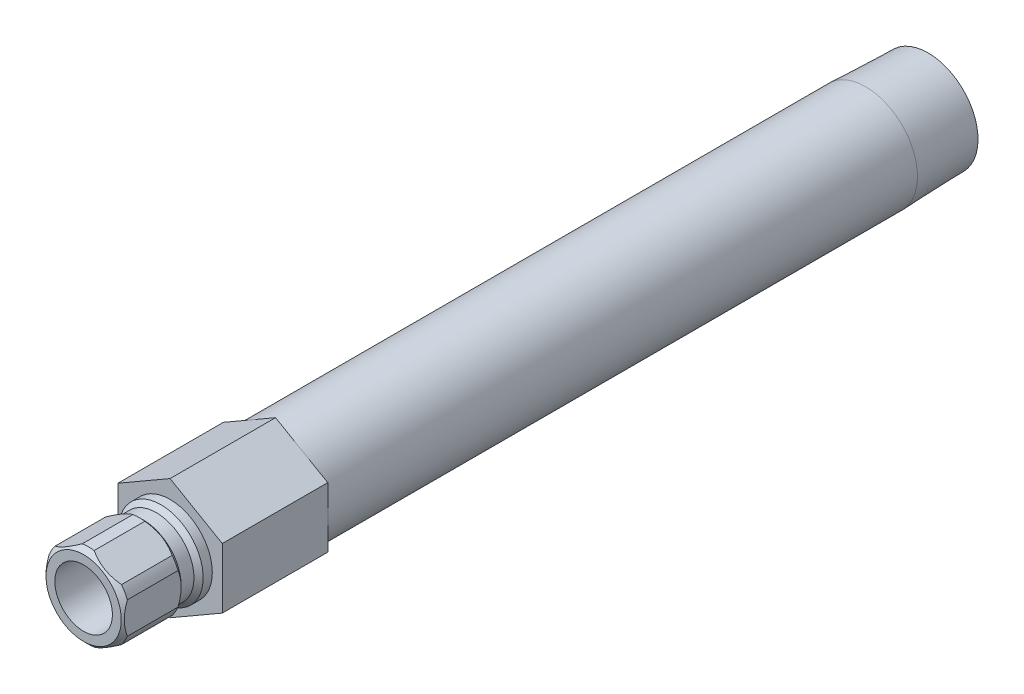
ISO-10303-21;
HEADER;
FILE_DESCRIPTION(('STEP AP214'),'2;1');
FILE_NAME('part.step','',(''),(''),'','','');
FILE_SCHEMA(('AUTOMOTIVE_DESIGN { 1 0 10303 214 1 1 1 1 }'));
ENDSEC;
DATA;
#1=APPLICATION_CONTEXT('core data for automotive mechanical design processes');
#2=APPLICATION_PROTOCOL_DEFINITION('international standard','automotive_design',2000,#1);
#3=PRODUCT_CONTEXT('',#1,'mechanical');
#4=PRODUCT('Part','Part','',(#3));
#5=PRODUCT_RELATED_PRODUCT_CATEGORY('part','',(#4));
#6=PRODUCT_DEFINITION_FORMATION('','',#4);
#7=PRODUCT_DEFINITION_CONTEXT('part definition',#1,'design');
#8=PRODUCT_DEFINITION('design','',#6,#7);
#9=PRODUCT_DEFINITION_SHAPE('','',#8);
#10=(LENGTH_UNIT() NAMED_UNIT(*) SI_UNIT(.MILLI.,.METRE.));
#11=(NAMED_UNIT(*) PLANE_ANGLE_UNIT() SI_UNIT($,.RADIAN.));
#12=(NAMED_UNIT(*) SI_UNIT($,.STERADIAN.) SOLID_ANGLE_UNIT());
#13=UNCERTAINTY_MEASURE_WITH_UNIT(LENGTH_MEASURE(1.E-05),#10,'distance_accuracy_value','');
#14=(GEOMETRIC_REPRESENTATION_CONTEXT(3) GLOBAL_UNCERTAINTY_ASSIGNED_CONTEXT((#13)) GLOBAL_UNIT_ASSIGNED_CONTEXT((#10,
#11,#12)) REPRESENTATION_CONTEXT('',''));
#15=CARTESIAN_POINT('',(0.,0.,0.));
#16=DIRECTION('',(0.,0.,1.));
#17=DIRECTION('',(1.,0.,0.));
#18=AXIS2_PLACEMENT_3D('',#15,#16,#17);
#19=CARTESIAN_POINT('',(0.,0.,0.));
#20=DIRECTION('',(0.,0.,-1.));
#21=DIRECTION('',(0.,1.,0.));
#22=AXIS2_PLACEMENT_3D('',#19,#20,#21);
#23=CYLINDRICAL_SURFACE('',#22,6.985);
#24=DIRECTION('',(0.,0.,-1.));
#25=VECTOR('',#24,1.);
#26=CARTESIAN_POINT('',(5.50323442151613,-4.30170151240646,0.));
#27=LINE('',#26,#25);
#28=CARTESIAN_POINT('',(5.50323442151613,-4.30170151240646,5.1562));
#29=VERTEX_POINT('',#28);
#30=CARTESIAN_POINT('',(5.50323442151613,-4.30170151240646,13.5382));
#31=VERTEX_POINT('',#30);
#32=EDGE_CURVE('E406',#29,#31,#27,.F.);
#33=ORIENTED_EDGE('',*,*,#32,.F.);
#34=CARTESIAN_POINT('',(0.,0.,5.1562));
#35=DIRECTION('',(0.,0.,-1.));
#36=DIRECTION('',(0.,1.,0.));
#37=AXIS2_PLACEMENT_3D('',#34,#35,#36);
#38=CIRCLE('',#37,6.985);
#39=CARTESIAN_POINT('',(6.477,-2.6150900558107,5.1562));
#40=VERTEX_POINT('',#39);
#41=EDGE_CURVE('E383',#40,#29,#38,.T.);
#42=ORIENTED_EDGE('',*,*,#41,.F.);
#43=DIRECTION('',(0.,0.,-1.));
#44=VECTOR('',#43,1.);
#45=CARTESIAN_POINT('',(6.477,-2.6150900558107,0.));
#46=LINE('',#45,#44);
#47=CARTESIAN_POINT('',(6.477,-2.6150900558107,13.5382));
#48=VERTEX_POINT('',#47);
#49=EDGE_CURVE('E397',#48,#40,#46,.T.);
#50=ORIENTED_EDGE('',*,*,#49,.F.);
#51=CARTESIAN_POINT('',(0.,0.,13.5382));
#52=DIRECTION('',(0.,0.,-1.));
#53=DIRECTION('',(0.,1.,0.));
#54=AXIS2_PLACEMENT_3D('',#51,#52,#53);
#55=CIRCLE('',#54,6.985);
#56=EDGE_CURVE('E191',#48,#31,#55,.T.);
#57=ORIENTED_EDGE('',*,*,#56,.T.);
#58=EDGE_LOOP('',(#33,#42,#50,#57));
#59=FACE_BOUND('',#58,.T.);
#60=ADVANCED_FACE('F34',(#59),#23,.T.);
#61=DIRECTION('',(0.,0.,-1.));
#62=VECTOR('',#61,1.);
#63=CARTESIAN_POINT('',(6.477,2.61509005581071,0.));
#64=LINE('',#63,#62);
#65=CARTESIAN_POINT('',(6.477,2.6150900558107,5.1562));
#66=VERTEX_POINT('',#65);
#67=CARTESIAN_POINT('',(6.477,2.61509005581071,13.5382));
#68=VERTEX_POINT('',#67);
#69=EDGE_CURVE('E309',#66,#68,#64,.F.);
#70=ORIENTED_EDGE('',*,*,#69,.F.);
#71=CARTESIAN_POINT('',(5.50323442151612,4.30170151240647,5.1562));
#72=VERTEX_POINT('',#71);
#73=EDGE_CURVE('E204',#72,#66,#38,.T.);
#74=ORIENTED_EDGE('',*,*,#73,.F.);
#75=DIRECTION('',(0.,0.,-1.));
#76=VECTOR('',#75,1.);
#77=CARTESIAN_POINT('',(5.50323442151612,4.30170151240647,0.));
#78=LINE('',#77,#76);
#79=CARTESIAN_POINT('',(5.50323442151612,4.30170151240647,13.5382));
#80=VERTEX_POINT('',#79);
#81=EDGE_CURVE('E394',#80,#72,#78,.T.);
#82=ORIENTED_EDGE('',*,*,#81,.F.);
#83=EDGE_CURVE('E198',#80,#68,#55,.T.);
#84=ORIENTED_EDGE('',*,*,#83,.T.);
#85=EDGE_LOOP('',(#70,#74,#82,#84));
#86=FACE_BOUND('',#85,.T.);
#87=ADVANCED_FACE('F343',(#86),#23,.T.);
#88=DIRECTION('',(0.,0.,-1.));
#89=VECTOR('',#88,1.);
#90=CARTESIAN_POINT('',(0.973765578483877,6.91679156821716,0.));
#91=LINE('',#90,#89);
#92=CARTESIAN_POINT('',(0.973765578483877,6.91679156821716,5.1562));
#93=VERTEX_POINT('',#92);
#94=CARTESIAN_POINT('',(0.973765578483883,6.91679156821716,13.5382));
#95=VERTEX_POINT('',#94);
#96=EDGE_CURVE('E399',#93,#95,#91,.F.);
#97=ORIENTED_EDGE('',*,*,#96,.F.);
#98=CARTESIAN_POINT('',(-0.973765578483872,6.91679156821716,5.1562));
#99=VERTEX_POINT('',#98);
#100=EDGE_CURVE('E200',#99,#93,#38,.T.);
#101=ORIENTED_EDGE('',*,*,#100,.F.);
#102=DIRECTION('',(0.,0.,-1.));
#103=VECTOR('',#102,1.);
#104=CARTESIAN_POINT('',(-0.973765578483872,6.91679156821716,0.));
#105=LINE('',#104,#103);
#106=CARTESIAN_POINT('',(-0.973765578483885,6.91679156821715,13.5382));
#107=VERTEX_POINT('',#106);
#108=EDGE_CURVE('E375',#107,#99,#105,.T.);
#109=ORIENTED_EDGE('',*,*,#108,.F.);
#110=EDGE_CURVE('E193',#107,#95,#55,.T.);
#111=ORIENTED_EDGE('',*,*,#110,.T.);
#112=EDGE_LOOP('',(#97,#101,#109,#111));
#113=FACE_BOUND('',#112,.T.);
#114=ADVANCED_FACE('F348',(#113),#23,.T.);
#115=DIRECTION('',(0.,0.,-1.));
#116=VECTOR('',#115,1.);
#117=CARTESIAN_POINT('',(-5.50323442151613,4.30170151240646,0.));
#118=LINE('',#117,#116);
#119=CARTESIAN_POINT('',(-5.50323442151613,4.30170151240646,5.1562));
#120=VERTEX_POINT('',#119);
#121=CARTESIAN_POINT('',(-5.50323442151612,4.30170151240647,13.5382));
#122=VERTEX_POINT('',#121);
#123=EDGE_CURVE('E54',#120,#122,#118,.F.);
#124=ORIENTED_EDGE('',*,*,#123,.F.);
#125=CARTESIAN_POINT('',(-6.477,2.61509005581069,5.1562));
#126=VERTEX_POINT('',#125);
#127=EDGE_CURVE('E203',#126,#120,#38,.T.);
#128=ORIENTED_EDGE('',*,*,#127,.F.);
#129=DIRECTION('',(0.,0.,-1.));
#130=VECTOR('',#129,1.);
#131=CARTESIAN_POINT('',(-6.477,2.61509005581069,0.));
#132=LINE('',#131,#130);
#133=CARTESIAN_POINT('',(-6.477,2.61509005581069,13.5382));
#134=VERTEX_POINT('',#133);
#135=EDGE_CURVE('E263',#134,#126,#132,.T.);
#136=ORIENTED_EDGE('',*,*,#135,.F.);
#137=EDGE_CURVE('E189',#134,#122,#55,.T.);
#138=ORIENTED_EDGE('',*,*,#137,.T.);
#139=EDGE_LOOP('',(#124,#128,#136,#138));
#140=FACE_BOUND('',#139,.T.);
#141=ADVANCED_FACE('F360',(#140),#23,.T.);
#142=DIRECTION('',(0.,0.,-1.));
#143=VECTOR('',#142,1.);
#144=CARTESIAN_POINT('',(-6.477,-2.61509005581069,0.));
#145=LINE('',#144,#143);
#146=CARTESIAN_POINT('',(-6.477,-2.61509005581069,5.1562));
#147=VERTEX_POINT('',#146);
#148=CARTESIAN_POINT('',(-6.477,-2.6150900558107,13.5382));
#149=VERTEX_POINT('',#148);
#150=EDGE_CURVE('E62',#147,#149,#145,.F.);
#151=ORIENTED_EDGE('',*,*,#150,.F.);
#152=CARTESIAN_POINT('',(-5.50323442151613,-4.30170151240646,5.1562));
#153=VERTEX_POINT('',#152);
#154=EDGE_CURVE('E182',#153,#147,#38,.T.);
#155=ORIENTED_EDGE('',*,*,#154,.F.);
#156=DIRECTION('',(0.,0.,-1.));
#157=VECTOR('',#156,1.);
#158=CARTESIAN_POINT('',(-5.50323442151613,-4.30170151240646,0.));
#159=LINE('',#158,#157);
#160=CARTESIAN_POINT('',(-5.50323442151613,-4.30170151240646,13.5382));
#161=VERTEX_POINT('',#160);
#162=EDGE_CURVE('E165',#161,#153,#159,.T.);
#163=ORIENTED_EDGE('',*,*,#162,.F.);
#164=EDGE_CURVE('E180',#161,#149,#55,.T.);
#165=ORIENTED_EDGE('',*,*,#164,.T.);
#166=EDGE_LOOP('',(#151,#155,#163,#165));
#167=FACE_BOUND('',#166,.T.);
#168=ADVANCED_FACE('F179',(#167),#23,.T.);
#169=CARTESIAN_POINT('',(0.,0.,0.));
#170=DIRECTION('',(0.,0.,-1.));
#171=DIRECTION('',(0.,1.,0.));
#172=AXIS2_PLACEMENT_3D('',#169,#170,#171);
#173=CYLINDRICAL_SURFACE('',#172,8.57249999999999);
#174=CARTESIAN_POINT('',(0.,0.,-115.062));
#175=DIRECTION('',(0.,0.,-1.));
#176=DIRECTION('',(0.,1.,0.));
#177=AXIS2_PLACEMENT_3D('',#174,#175,#176);
#178=CIRCLE('',#177,8.57249999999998);
#179=CARTESIAN_POINT('',(0.,8.5725,-115.062));
#180=VERTEX_POINT('',#179);
#181=EDGE_CURVE('E214',#180,#180,#178,.T.);
#182=ORIENTED_EDGE('',*,*,#181,.F.);
#183=EDGE_LOOP('',(#182));
#184=FACE_BOUND('',#183,.T.);
#185=CARTESIAN_POINT('',(0.,0.,-17.4498));
#186=DIRECTION('',(0.,0.,1.));
#187=DIRECTION('',(1.,0.,0.));
#188=AXIS2_PLACEMENT_3D('',#185,#186,#187);
#189=CIRCLE('',#188,8.57249999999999);
#190=CARTESIAN_POINT('',(8.57249999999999,0.,-17.4498));
#191=VERTEX_POINT('',#190);
#192=EDGE_CURVE('E231',#191,#191,#189,.F.);
#193=ORIENTED_EDGE('',*,*,#192,.T.);
#194=EDGE_LOOP('',(#193));
#195=FACE_BOUND('',#194,.T.);
#196=ADVANCED_FACE('F359',(#184,#195),#173,.T.);
#197=CARTESIAN_POINT('',(0.,0.,0.));
#198=DIRECTION('',(0.,0.,-1.));
#199=DIRECTION('',(0.,1.,0.));
#200=AXIS2_PLACEMENT_3D('',#197,#198,#199);
#201=CYLINDRICAL_SURFACE('',#200,4.76249999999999);
#202=CARTESIAN_POINT('',(0.,0.,14.3002));
#203=DIRECTION('',(0.,0.,-1.));
#204=DIRECTION('',(0.,1.,0.));
#205=AXIS2_PLACEMENT_3D('',#202,#203,#204);
#206=CIRCLE('',#205,4.7625);
#207=CARTESIAN_POINT('',(0.,4.7625,14.3002));
#208=VERTEX_POINT('',#207);
#209=EDGE_CURVE('E233',#208,#208,#206,.T.);
#210=ORIENTED_EDGE('',*,*,#209,.F.);
#211=EDGE_LOOP('',(#210));
#212=FACE_BOUND('',#211,.T.);
#213=CARTESIAN_POINT('',(0.,0.,-17.4498));
#214=DIRECTION('',(0.,0.,-1.));
#215=DIRECTION('',(0.,1.,0.));
#216=AXIS2_PLACEMENT_3D('',#213,#214,#215);
#217=CIRCLE('',#216,4.76249999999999);
#218=CARTESIAN_POINT('',(0.,4.7625,-17.4498));
#219=VERTEX_POINT('',#218);
#220=EDGE_CURVE('E226',#219,#219,#217,.T.);
#221=ORIENTED_EDGE('',*,*,#220,.T.);
#222=EDGE_LOOP('',(#221));
#223=FACE_BOUND('',#222,.T.);
#224=ADVANCED_FACE('F36',(#212,#223),#201,.F.);
#225=CARTESIAN_POINT('',(0.,4.7625,-17.4498));
#226=DIRECTION('',(0.,0.,-1.));
#227=DIRECTION('',(0.,1.,0.));
#228=AXIS2_PLACEMENT_3D('',#225,#226,#227);
#229=PLANE('',#228);
#230=CARTESIAN_POINT('',(0.,0.,-17.4498));
#231=DIRECTION('',(0.,0.,-1.));
#232=DIRECTION('',(0.,1.,0.));
#233=AXIS2_PLACEMENT_3D('',#230,#231,#232);
#234=CIRCLE('',#233,6.26109999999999);
#235=CARTESIAN_POINT('',(0.,6.2611,-17.4498));
#236=VERTEX_POINT('',#235);
#237=EDGE_CURVE('E223',#236,#236,#234,.T.);
#238=ORIENTED_EDGE('',*,*,#237,.T.);
#239=EDGE_LOOP('',(#238));
#240=FACE_BOUND('',#239,.T.);
#241=ORIENTED_EDGE('',*,*,#220,.F.);
#242=EDGE_LOOP('',(#241));
#243=FACE_BOUND('',#242,.T.);
#244=ADVANCED_FACE('F687',(#240,#243),#229,.T.);
#245=CARTESIAN_POINT('',(0.,0.,0.));
#246=DIRECTION('',(0.,0.,-1.));
#247=DIRECTION('',(0.,1.,0.));
#248=AXIS2_PLACEMENT_3D('',#245,#246,#247);
#249=CYLINDRICAL_SURFACE('',#248,6.26109999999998);
#250=CARTESIAN_POINT('',(0.,0.,-125.3998));
#251=DIRECTION('',(0.,0.,-1.));
#252=DIRECTION('',(0.,1.,0.));
#253=AXIS2_PLACEMENT_3D('',#250,#251,#252);
#254=CIRCLE('',#253,6.26109999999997);
#255=CARTESIAN_POINT('',(0.,6.2611,-125.3998));
#256=VERTEX_POINT('',#255);
#257=EDGE_CURVE('E220',#256,#256,#254,.T.);
#258=ORIENTED_EDGE('',*,*,#257,.T.);
#259=EDGE_LOOP('',(#258));
#260=FACE_BOUND('',#259,.T.);
#261=ORIENTED_EDGE('',*,*,#237,.F.);
#262=EDGE_LOOP('',(#261));
#263=FACE_BOUND('',#262,.T.);
#264=ADVANCED_FACE('F678',(#260,#263),#249,.F.);
#265=CARTESIAN_POINT('',(0.,8.24944566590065,-125.3998));
#266=DIRECTION('',(0.,0.,-1.));
#267=DIRECTION('',(0.,1.,0.));
#268=AXIS2_PLACEMENT_3D('',#265,#266,#267);
#269=PLANE('',#268);
#270=CARTESIAN_POINT('',(0.,0.,-125.3998));
#271=DIRECTION('',(0.,0.,-1.));
#272=DIRECTION('',(0.,1.,0.));
#273=AXIS2_PLACEMENT_3D('',#270,#271,#272);
#274=CIRCLE('',#273,8.24944566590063);
#275=CARTESIAN_POINT('',(0.,8.24944566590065,-125.3998));
#276=VERTEX_POINT('',#275);
#277=EDGE_CURVE('E217',#276,#276,#274,.T.);
#278=ORIENTED_EDGE('',*,*,#277,.T.);
#279=EDGE_LOOP('',(#278));
#280=FACE_BOUND('',#279,.T.);
#281=ORIENTED_EDGE('',*,*,#257,.F.);
#282=EDGE_LOOP('',(#281));
#283=FACE_BOUND('',#282,.T.);
#284=ADVANCED_FACE('F669',(#280,#283),#269,.T.);
#285=CARTESIAN_POINT('',(0.,0.,-125.3998));
#286=DIRECTION('',(0.,0.,1.));
#287=DIRECTION('',(0.,-1.,0.));
#288=AXIS2_PLACEMENT_3D('',#285,#286,#287);
#289=CONICAL_SURFACE('',#288,8.24944566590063,0.0312396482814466);
#290=ORIENTED_EDGE('',*,*,#181,.T.);
#291=EDGE_LOOP('',(#290));
#292=FACE_BOUND('',#291,.T.);
#293=ORIENTED_EDGE('',*,*,#277,.F.);
#294=EDGE_LOOP('',(#293));
#295=FACE_BOUND('',#294,.T.);
#296=ADVANCED_FACE('F661',(#292,#295),#289,.T.);
#297=CARTESIAN_POINT('',(0.,0.,0.));
#298=DIRECTION('',(0.,0.,-1.));
#299=DIRECTION('',(0.,1.,0.));
#300=AXIS2_PLACEMENT_3D('',#297,#298,#299);
#301=CYLINDRICAL_SURFACE('',#300,6.985);
#302=CARTESIAN_POINT('',(0.,0.,0.));
#303=DIRECTION('',(0.,0.,1.));
#304=DIRECTION('',(1.,0.,0.));
#305=AXIS2_PLACEMENT_3D('',#302,#303,#304);
#306=CIRCLE('',#305,6.985);
#307=CARTESIAN_POINT('',(6.985,0.,0.));
#308=VERTEX_POINT('',#307);
#309=EDGE_CURVE('E174',#308,#308,#306,.F.);
#310=ORIENTED_EDGE('',*,*,#309,.F.);
#311=EDGE_LOOP('',(#310));
#312=FACE_BOUND('',#311,.T.);
#313=CARTESIAN_POINT('',(0.,0.,1.50875999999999));
#314=DIRECTION('',(0.,0.,-1.));
#315=DIRECTION('',(0.,1.,0.));
#316=AXIS2_PLACEMENT_3D('',#313,#314,#315);
#317=CIRCLE('',#316,6.985);
#318=CARTESIAN_POINT('',(0.,6.985,1.50876));
#319=VERTEX_POINT('',#318);
#320=EDGE_CURVE('E211',#319,#319,#317,.T.);
#321=ORIENTED_EDGE('',*,*,#320,.T.);
#322=EDGE_LOOP('',(#321));
#323=FACE_BOUND('',#322,.T.);
#324=ADVANCED_FACE('F653',(#312,#323),#301,.T.);
#325=CARTESIAN_POINT('',(0.,0.,1.50875999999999));
#326=DIRECTION('',(0.,0.,-1.));
#327=DIRECTION('',(0.,1.,0.));
#328=AXIS2_PLACEMENT_3D('',#325,#326,#327);
#329=CONICAL_SURFACE('',#328,6.985,0.785398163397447);
#330=CARTESIAN_POINT('',(0.,0.,2.27076));
#331=DIRECTION('',(0.,0.,-1.));
#332=DIRECTION('',(0.,1.,0.));
#333=AXIS2_PLACEMENT_3D('',#330,#331,#332);
#334=CIRCLE('',#333,6.223);
#335=CARTESIAN_POINT('',(0.,6.223,2.27076));
#336=VERTEX_POINT('',#335);
#337=EDGE_CURVE('E208',#336,#336,#334,.T.);
#338=ORIENTED_EDGE('',*,*,#337,.T.);
#339=EDGE_LOOP('',(#338));
#340=FACE_BOUND('',#339,.T.);
#341=ORIENTED_EDGE('',*,*,#320,.F.);
#342=EDGE_LOOP('',(#341));
#343=FACE_BOUND('',#342,.T.);
#344=ADVANCED_FACE('F645',(#340,#343),#329,.T.);
#345=CARTESIAN_POINT('',(0.,0.,0.));
#346=DIRECTION('',(0.,0.,-1.));
#347=DIRECTION('',(0.,1.,0.));
#348=AXIS2_PLACEMENT_3D('',#345,#346,#347);
#349=CYLINDRICAL_SURFACE('',#348,6.223);
#350=CARTESIAN_POINT('',(0.,0.,4.3942));
#351=DIRECTION('',(0.,0.,-1.));
#352=DIRECTION('',(0.,1.,0.));
#353=AXIS2_PLACEMENT_3D('',#350,#351,#352);
#354=CIRCLE('',#353,6.223);
#355=CARTESIAN_POINT('',(0.,6.223,4.3942));
#356=VERTEX_POINT('',#355);
#357=EDGE_CURVE('E205',#356,#356,#354,.T.);
#358=ORIENTED_EDGE('',*,*,#357,.T.);
#359=EDGE_LOOP('',(#358));
#360=FACE_BOUND('',#359,.T.);
#361=ORIENTED_EDGE('',*,*,#337,.F.);
#362=EDGE_LOOP('',(#361));
#363=FACE_BOUND('',#362,.T.);
#364=ADVANCED_FACE('F270',(#360,#363),#349,.T.);
#365=CARTESIAN_POINT('',(0.,0.,4.3942));
#366=DIRECTION('',(0.,0.,1.));
#367=DIRECTION('',(0.,-1.,0.));
#368=AXIS2_PLACEMENT_3D('',#365,#366,#367);
#369=CONICAL_SURFACE('',#368,6.223,0.785398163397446);
#370=CARTESIAN_POINT('',(0.973302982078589,-6.91705864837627,5.1564));
#371=CARTESIAN_POINT('',(1.1543052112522,-6.81255696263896,5.07808330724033));
#372=CARTESIAN_POINT('',(1.3378209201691,-6.70660411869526,5.00684558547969));
#373=CARTESIAN_POINT('',(1.70963160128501,-6.49193912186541,4.88134753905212));
#374=CARTESIAN_POINT('',(1.89793754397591,-6.38322063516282,4.82713086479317));
#375=CARTESIAN_POINT('',(2.27146153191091,-6.16756646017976,4.74047563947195));
#376=CARTESIAN_POINT('',(2.45655498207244,-6.06070270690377,4.70733772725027));
#377=CARTESIAN_POINT('',(2.82844640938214,-5.8459910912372,4.66198043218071));
#378=CARTESIAN_POINT('',(3.0152419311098,-5.73814464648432,4.64973461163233));
#379=CARTESIAN_POINT('',(3.3948057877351,-5.51900335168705,4.64689437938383));
#380=CARTESIAN_POINT('',(3.58757842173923,-5.40770601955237,4.65698827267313));
#381=CARTESIAN_POINT('',(3.97148128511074,-5.18605959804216,4.69952919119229));
#382=CARTESIAN_POINT('',(4.1626089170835,-5.07571200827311,4.73200667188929));
#383=CARTESIAN_POINT('',(4.54854122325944,-4.85289388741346,4.81877263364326));
#384=CARTESIAN_POINT('',(4.74321398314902,-4.74049951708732,4.87383522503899));
#385=CARTESIAN_POINT('',(5.03141021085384,-4.57410934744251,4.97019209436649));
#386=CARTESIAN_POINT('',(5.12673323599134,-4.51907457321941,5.00455772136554));
#387=CARTESIAN_POINT('',(5.31613879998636,-4.40972121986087,5.07745547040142));
#388=CARTESIAN_POINT('',(5.41022179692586,-4.35540237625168,5.11598600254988));
#389=CARTESIAN_POINT('',(5.5036970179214,-4.30143443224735,5.1564));
#390=B_SPLINE_CURVE_WITH_KNOTS('',3,(#370,#371,#372,#373,#374,#375,#376,#377,#378,#379,#380,
#381,#382,#383,#384,#385,#386,#387,#388,#389),.UNSPECIFIED.,.F.,.F.,(4,2,2,2,2,2,2,2,2,4),(0.,
0.669810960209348,1.34132587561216,1.9892054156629,2.63626449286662,3.3035366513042,
3.9717185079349,4.66502165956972,5.01088265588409,5.35661208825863),.UNSPECIFIED.);
#391=CARTESIAN_POINT('',(0.973765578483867,-6.91679156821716,5.1562));
#392=VERTEX_POINT('',#391);
#393=EDGE_CURVE('E408',#392,#29,#390,.T.);
#394=ORIENTED_EDGE('',*,*,#393,.F.);
#395=CARTESIAN_POINT('',(-0.973765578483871,-6.91679156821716,5.1562));
#396=VERTEX_POINT('',#395);
#397=EDGE_CURVE('E381',#392,#396,#38,.T.);
#398=ORIENTED_EDGE('',*,*,#397,.T.);
#399=CARTESIAN_POINT('',(-5.50369701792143,-4.30143443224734,5.15640000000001));
#400=CARTESIAN_POINT('',(-5.32269478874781,-4.40593611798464,5.07808330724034));
#401=CARTESIAN_POINT('',(-5.13917907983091,-4.51188896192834,5.0068455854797));
#402=CARTESIAN_POINT('',(-4.767368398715,-4.72655395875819,4.88134753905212));
#403=CARTESIAN_POINT('',(-4.5790624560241,-4.83527244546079,4.82713086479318));
#404=CARTESIAN_POINT('',(-4.2055384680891,-5.05092662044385,4.74047563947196));
#405=CARTESIAN_POINT('',(-4.02044501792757,-5.15779037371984,4.70733772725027));
#406=CARTESIAN_POINT('',(-3.64855359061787,-5.37250198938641,4.66198043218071));
#407=CARTESIAN_POINT('',(-3.46175806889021,-5.48034843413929,4.64973461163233));
#408=CARTESIAN_POINT('',(-3.08219421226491,-5.69948972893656,4.64689437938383));
#409=CARTESIAN_POINT('',(-2.88942157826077,-5.81078706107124,4.65698827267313));
#410=CARTESIAN_POINT('',(-2.50551871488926,-6.03243348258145,4.69952919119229));
#411=CARTESIAN_POINT('',(-2.3143910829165,-6.1427810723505,4.73200667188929));
#412=CARTESIAN_POINT('',(-1.92845877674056,-6.36559919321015,4.81877263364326));
#413=CARTESIAN_POINT('',(-1.73378601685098,-6.47799356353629,4.87383522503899));
#414=CARTESIAN_POINT('',(-1.44558978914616,-6.6443837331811,4.97019209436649));
#415=CARTESIAN_POINT('',(-1.35026676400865,-6.69941850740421,5.00455772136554));
#416=CARTESIAN_POINT('',(-1.16086120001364,-6.80877186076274,5.07745547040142));
#417=CARTESIAN_POINT('',(-1.06677820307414,-6.86309070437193,5.11598600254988));
#418=CARTESIAN_POINT('',(-0.973302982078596,-6.91705864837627,5.1564));
#419=B_SPLINE_CURVE_WITH_KNOTS('',3,(#399,#400,#401,#402,#403,#404,#405,#406,#407,#408,#409,
#410,#411,#412,#413,#414,#415,#416,#417,#418),.UNSPECIFIED.,.F.,.F.,(4,2,2,2,2,2,2,2,2,4),(0.,
0.669810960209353,1.34132587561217,1.98920541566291,2.63626449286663,3.30353665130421,
3.97171850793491,4.66502165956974,5.01088265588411,5.35661208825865),.UNSPECIFIED.);
#420=EDGE_CURVE('E256',#153,#396,#419,.T.);
#421=ORIENTED_EDGE('',*,*,#420,.F.);
#422=ORIENTED_EDGE('',*,*,#154,.T.);
#423=CARTESIAN_POINT('',(-6.477,-7.50531717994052,8.08489330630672));
#424=CARTESIAN_POINT('',(-6.477,-7.32278230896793,7.94673378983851));
#425=CARTESIAN_POINT('',(-6.477,-7.13923073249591,7.80989578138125));
#426=CARTESIAN_POINT('',(-6.477,-6.76969107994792,7.53945615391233));
#427=CARTESIAN_POINT('',(-6.477,-6.58370240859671,7.40585534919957));
#428=CARTESIAN_POINT('',(-6.477,-6.20752484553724,7.14153325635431));
#429=CARTESIAN_POINT('',(-6.477,-6.01731457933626,7.01084228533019));
#430=CARTESIAN_POINT('',(-6.477,-5.63367369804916,6.75429124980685));
#431=CARTESIAN_POINT('',(-6.477,-5.44024331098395,6.62843084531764));
#432=CARTESIAN_POINT('',(-6.477,-5.03831720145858,6.37548971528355));
#433=CARTESIAN_POINT('',(-6.477,-4.82959841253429,6.24876164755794));
#434=CARTESIAN_POINT('',(-6.477,-4.40728395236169,6.00357587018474));
#435=CARTESIAN_POINT('',(-6.477,-4.19368750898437,5.88511948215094));
#436=CARTESIAN_POINT('',(-6.477,-3.7616267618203,5.6590284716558));
#437=CARTESIAN_POINT('',(-6.477,-3.54317924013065,5.55136202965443));
#438=CARTESIAN_POINT('',(-6.477,-3.100295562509,5.34926153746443));
#439=CARTESIAN_POINT('',(-6.477,-2.87586219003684,5.25482146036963));
#440=CARTESIAN_POINT('',(-6.477,-2.43955826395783,5.0897033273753));
#441=CARTESIAN_POINT('',(-6.477,-2.22819339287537,5.0177028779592));
#442=CARTESIAN_POINT('',(-6.477,-1.80033354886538,4.8906524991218));
#443=CARTESIAN_POINT('',(-6.477,-1.58383822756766,4.8356037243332));
#444=CARTESIAN_POINT('',(-6.477,-1.15063390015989,4.74626140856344));
#445=CARTESIAN_POINT('',(-6.477,-0.934000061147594,4.7116093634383));
#446=CARTESIAN_POINT('',(-6.477,-0.498364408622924,4.66374056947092));
#447=CARTESIAN_POINT('',(-6.477,-0.279363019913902,4.65052003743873));
#448=CARTESIAN_POINT('',(-6.477,0.15069719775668,4.64651642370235));
#449=CARTESIAN_POINT('',(-6.477,0.361748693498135,4.65491764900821));
#450=CARTESIAN_POINT('',(-6.477,0.782066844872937,4.69188275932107));
#451=CARTESIAN_POINT('',(-6.477,0.991333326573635,4.72044858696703));
#452=CARTESIAN_POINT('',(-6.477,1.41010575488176,4.79666246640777));
#453=CARTESIAN_POINT('',(-6.477,1.61955133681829,4.84463689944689));
#454=CARTESIAN_POINT('',(-6.477,2.03387291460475,4.95709535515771));
#455=CARTESIAN_POINT('',(-6.477,2.2387492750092,5.0215780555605));
#456=CARTESIAN_POINT('',(-6.477,2.66141718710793,5.17064013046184));
#457=CARTESIAN_POINT('',(-6.477,2.87875617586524,5.25648961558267));
#458=CARTESIAN_POINT('',(-6.477,3.30779766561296,5.44138196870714));
#459=CARTESIAN_POINT('',(-6.477,3.51949749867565,5.54043095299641));
#460=CARTESIAN_POINT('',(-6.477,3.93828980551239,5.74936705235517));
#461=CARTESIAN_POINT('',(-6.477,4.14536521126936,5.85928810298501));
#462=CARTESIAN_POINT('',(-6.477,4.55475391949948,6.08754039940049));
#463=CARTESIAN_POINT('',(-6.477,4.75706796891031,6.20587031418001));
#464=CARTESIAN_POINT('',(-6.477,5.14761370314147,6.44323908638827));
#465=CARTESIAN_POINT('',(-6.477,5.33604552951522,6.56195038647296));
#466=CARTESIAN_POINT('',(-6.477,5.7096738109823,6.80437488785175));
#467=CARTESIAN_POINT('',(-6.477,5.89487001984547,6.92808846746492));
#468=CARTESIAN_POINT('',(-6.477,6.26095063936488,7.17860412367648));
#469=CARTESIAN_POINT('',(-6.477,6.44185783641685,7.3053730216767));
#470=CARTESIAN_POINT('',(-6.477,6.8011983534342,7.56227065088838));
#471=CARTESIAN_POINT('',(-6.477,6.97963234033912,7.69239844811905));
#472=CARTESIAN_POINT('',(-6.477,7.15703038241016,7.82389977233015));
#473=B_SPLINE_CURVE_WITH_KNOTS('',3,(#423,#424,#425,#426,#427,#428,#429,#430,#431,#432,#433,
#434,#435,#436,#437,#438,#439,#440,#441,#442,#443,#444,#445,#446,#447,#448,#449,#450,#451,#452,
#453,#454,#455,#456,#457,#458,#459,#460,#461,#462,#463,#464,#465,#466,#467,#468,#469,#470,#471,
#472),.UNSPECIFIED.,.F.,.F.,(4,2,2,2,2,2,2,2,2,2,2,2,2,2,2,2,2,2,2,2,2,2,2,2,4),(0.,
0.686790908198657,1.37375281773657,2.06603541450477,2.75826919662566,3.49065471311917,
4.22315698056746,4.95343127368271,5.68337170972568,6.352659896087,7.02199365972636,
7.67918147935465,8.33625327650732,8.96890298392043,9.60161364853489,10.2454384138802,
10.8892116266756,11.5897073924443,12.2905288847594,12.9936114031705,13.6965828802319,
14.3646145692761,15.0326968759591,15.6953618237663,16.3578444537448),.UNSPECIFIED.);
#474=EDGE_CURVE('E279',#126,#147,#473,.F.);
#475=ORIENTED_EDGE('',*,*,#474,.F.);
#476=ORIENTED_EDGE('',*,*,#127,.T.);
#477=CARTESIAN_POINT('',(-0.973302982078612,6.91705864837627,5.1564));
#478=CARTESIAN_POINT('',(-1.15430521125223,6.81255696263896,5.07808330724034));
#479=CARTESIAN_POINT('',(-1.33782092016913,6.70660411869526,5.0068455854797));
#480=CARTESIAN_POINT('',(-1.70963160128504,6.49193912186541,4.88134753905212));
#481=CARTESIAN_POINT('',(-1.89793754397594,6.38322063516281,4.82713086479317));
#482=CARTESIAN_POINT('',(-2.27146153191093,6.16756646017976,4.74047563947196));
#483=CARTESIAN_POINT('',(-2.45655498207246,6.06070270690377,4.70733772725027));
#484=CARTESIAN_POINT('',(-2.82844640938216,5.8459910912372,4.66198043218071));
#485=CARTESIAN_POINT('',(-3.01524193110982,5.73814464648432,4.64973461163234));
#486=CARTESIAN_POINT('',(-3.39480578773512,5.51900335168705,4.64689437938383));
#487=CARTESIAN_POINT('',(-3.58757842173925,5.40770601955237,4.65698827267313));
#488=CARTESIAN_POINT('',(-3.97148128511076,5.18605959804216,4.6995291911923));
#489=CARTESIAN_POINT('',(-4.16260891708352,5.07571200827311,4.7320066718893));
#490=CARTESIAN_POINT('',(-4.54854122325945,4.85289388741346,4.81877263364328));
#491=CARTESIAN_POINT('',(-4.74321398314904,4.74049951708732,4.873835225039));
#492=CARTESIAN_POINT('',(-5.03141021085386,4.57410934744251,4.9701920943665));
#493=CARTESIAN_POINT('',(-5.12673323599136,4.51907457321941,5.00455772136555));
#494=CARTESIAN_POINT('',(-5.31613879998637,4.40972121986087,5.07745547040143));
#495=CARTESIAN_POINT('',(-5.41022179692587,4.35540237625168,5.11598600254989));
#496=CARTESIAN_POINT('',(-5.50369701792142,4.30143443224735,5.15640000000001));
#497=B_SPLINE_CURVE_WITH_KNOTS('',3,(#477,#478,#479,#480,#481,#482,#483,#484,#485,#486,#487,
#488,#489,#490,#491,#492,#493,#494,#495,#496),.UNSPECIFIED.,.F.,.F.,(4,2,2,2,2,2,2,2,2,4),(0.,
0.669810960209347,1.34132587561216,1.9892054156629,2.63626449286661,3.30353665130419,
3.97171850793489,4.66502165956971,5.01088265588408,5.35661208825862),.UNSPECIFIED.);
#498=EDGE_CURVE('E286',#99,#120,#497,.T.);
#499=ORIENTED_EDGE('',*,*,#498,.F.);
#500=ORIENTED_EDGE('',*,*,#100,.T.);
#501=CARTESIAN_POINT('',(5.50369701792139,4.30143443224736,5.1564));
#502=CARTESIAN_POINT('',(5.32269478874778,4.40593611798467,5.07808330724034));
#503=CARTESIAN_POINT('',(5.13917907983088,4.51188896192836,5.00684558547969));
#504=CARTESIAN_POINT('',(4.76736839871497,4.72655395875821,4.88134753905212));
#505=CARTESIAN_POINT('',(4.57906245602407,4.83527244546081,4.82713086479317));
#506=CARTESIAN_POINT('',(4.20553846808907,5.05092662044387,4.74047563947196));
#507=CARTESIAN_POINT('',(4.02044501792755,5.15779037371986,4.70733772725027));
#508=CARTESIAN_POINT('',(3.64855359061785,5.37250198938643,4.66198043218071));
#509=CARTESIAN_POINT('',(3.46175806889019,5.48034843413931,4.64973461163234));
#510=CARTESIAN_POINT('',(3.08219421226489,5.69948972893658,4.64689437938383));
#511=CARTESIAN_POINT('',(2.88942157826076,5.81078706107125,4.65698827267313));
#512=CARTESIAN_POINT('',(2.50551871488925,6.03243348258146,4.6995291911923));
#513=CARTESIAN_POINT('',(2.3143910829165,6.14278107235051,4.7320066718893));
#514=CARTESIAN_POINT('',(1.92845877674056,6.36559919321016,4.81877263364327));
#515=CARTESIAN_POINT('',(1.73378601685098,6.47799356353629,4.873835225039));
#516=CARTESIAN_POINT('',(1.44558978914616,6.6443837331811,4.97019209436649));
#517=CARTESIAN_POINT('',(1.35026676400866,6.69941850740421,5.00455772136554));
#518=CARTESIAN_POINT('',(1.16086120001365,6.80877186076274,5.07745547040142));
#519=CARTESIAN_POINT('',(1.06677820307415,6.86309070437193,5.11598600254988));
#520=CARTESIAN_POINT('',(0.973302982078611,6.91705864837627,5.1564));
#521=B_SPLINE_CURVE_WITH_KNOTS('',3,(#501,#502,#503,#504,#505,#506,#507,#508,#509,#510,#511,
#512,#513,#514,#515,#516,#517,#518,#519,#520),.UNSPECIFIED.,.F.,.F.,(4,2,2,2,2,2,2,2,2,4),(0.,
0.669810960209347,1.34132587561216,1.9892054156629,2.63626449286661,3.30353665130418,
3.97171850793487,4.66502165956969,5.01088265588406,5.35661208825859),.UNSPECIFIED.);
#522=EDGE_CURVE('E293',#72,#93,#521,.T.);
#523=ORIENTED_EDGE('',*,*,#522,.F.);
#524=ORIENTED_EDGE('',*,*,#73,.T.);
#525=CARTESIAN_POINT('',(6.477,-7.50531717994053,8.08489330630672));
#526=CARTESIAN_POINT('',(6.477,-7.32278230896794,7.94673378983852));
#527=CARTESIAN_POINT('',(6.477,-7.13923073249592,7.80989578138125));
#528=CARTESIAN_POINT('',(6.477,-6.76969107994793,7.53945615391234));
#529=CARTESIAN_POINT('',(6.477,-6.58370240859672,7.40585534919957));
#530=CARTESIAN_POINT('',(6.477,-6.20752484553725,7.14153325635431));
#531=CARTESIAN_POINT('',(6.477,-6.01731457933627,7.01084228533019));
#532=CARTESIAN_POINT('',(6.477,-5.63367369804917,6.75429124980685));
#533=CARTESIAN_POINT('',(6.477,-5.44024331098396,6.62843084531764));
#534=CARTESIAN_POINT('',(6.477,-5.03831720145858,6.37548971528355));
#535=CARTESIAN_POINT('',(6.477,-4.8295984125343,6.24876164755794));
#536=CARTESIAN_POINT('',(6.477,-4.4072839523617,6.00357587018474));
#537=CARTESIAN_POINT('',(6.477,-4.19368750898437,5.88511948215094));
#538=CARTESIAN_POINT('',(6.477,-3.7616267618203,5.6590284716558));
#539=CARTESIAN_POINT('',(6.477,-3.54317924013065,5.55136202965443));
#540=CARTESIAN_POINT('',(6.477,-3.100295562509,5.34926153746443));
#541=CARTESIAN_POINT('',(6.477,-2.87586219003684,5.25482146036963));
#542=CARTESIAN_POINT('',(6.477,-2.43955826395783,5.0897033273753));
#543=CARTESIAN_POINT('',(6.477,-2.22819339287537,5.0177028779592));
#544=CARTESIAN_POINT('',(6.477,-1.80033354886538,4.89065249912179));
#545=CARTESIAN_POINT('',(6.477,-1.58383822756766,4.8356037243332));
#546=CARTESIAN_POINT('',(6.477,-1.15063390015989,4.74626140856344));
#547=CARTESIAN_POINT('',(6.477,-0.934000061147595,4.71160936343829));
#548=CARTESIAN_POINT('',(6.477,-0.498364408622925,4.66374056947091));
#549=CARTESIAN_POINT('',(6.477,-0.279363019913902,4.65052003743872));
#550=CARTESIAN_POINT('',(6.477,0.150697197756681,4.64651642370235));
#551=CARTESIAN_POINT('',(6.477,0.361748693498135,4.6549176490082));
#552=CARTESIAN_POINT('',(6.477,0.782066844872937,4.69188275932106));
#553=CARTESIAN_POINT('',(6.477,0.991333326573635,4.72044858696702));
#554=CARTESIAN_POINT('',(6.477,1.41010575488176,4.79666246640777));
#555=CARTESIAN_POINT('',(6.477,1.6195513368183,4.84463689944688));
#556=CARTESIAN_POINT('',(6.477,2.03387291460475,4.95709535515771));
#557=CARTESIAN_POINT('',(6.477,2.2387492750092,5.02157805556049));
#558=CARTESIAN_POINT('',(6.477,2.66141718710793,5.17064013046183));
#559=CARTESIAN_POINT('',(6.477,2.87875617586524,5.25648961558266));
#560=CARTESIAN_POINT('',(6.477,3.30779766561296,5.44138196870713));
#561=CARTESIAN_POINT('',(6.477,3.51949749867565,5.54043095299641));
#562=CARTESIAN_POINT('',(6.477,3.93828980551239,5.74936705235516));
#563=CARTESIAN_POINT('',(6.477,4.14536521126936,5.859288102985));
#564=CARTESIAN_POINT('',(6.477,4.55475391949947,6.08754039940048));
#565=CARTESIAN_POINT('',(6.477,4.75706796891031,6.20587031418));
#566=CARTESIAN_POINT('',(6.477,5.14761370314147,6.44323908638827));
#567=CARTESIAN_POINT('',(6.477,5.33604552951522,6.56195038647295));
#568=CARTESIAN_POINT('',(6.477,5.7096738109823,6.80437488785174));
#569=CARTESIAN_POINT('',(6.477,5.89487001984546,6.92808846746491));
#570=CARTESIAN_POINT('',(6.477,6.26095063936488,7.17860412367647));
#571=CARTESIAN_POINT('',(6.477,6.44185783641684,7.3053730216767));
#572=CARTESIAN_POINT('',(6.477,6.80119835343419,7.56227065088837));
#573=CARTESIAN_POINT('',(6.477,6.97963234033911,7.69239844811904));
#574=CARTESIAN_POINT('',(6.477,7.15703038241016,7.82389977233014));
#575=B_SPLINE_CURVE_WITH_KNOTS('',3,(#525,#526,#527,#528,#529,#530,#531,#532,#533,#534,#535,
#536,#537,#538,#539,#540,#541,#542,#543,#544,#545,#546,#547,#548,#549,#550,#551,#552,#553,#554,
#555,#556,#557,#558,#559,#560,#561,#562,#563,#564,#565,#566,#567,#568,#569,#570,#571,#572,#573,
#574),.UNSPECIFIED.,.F.,.F.,(4,2,2,2,2,2,2,2,2,2,2,2,2,2,2,2,2,2,2,2,2,2,2,2,4),(0.,
0.686790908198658,1.37375281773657,2.06603541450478,2.75826919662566,3.49065471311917,
4.22315698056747,4.95343127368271,5.68337170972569,6.35265989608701,7.02199365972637,
7.67918147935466,8.33625327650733,8.96890298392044,9.6016136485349,10.2454384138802,
10.8892116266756,11.5897073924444,12.2905288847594,12.9936114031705,13.6965828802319,
14.3646145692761,15.0326968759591,15.6953618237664,16.3578444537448),.UNSPECIFIED.);
#576=EDGE_CURVE('E301',#40,#66,#575,.T.);
#577=ORIENTED_EDGE('',*,*,#576,.F.);
#578=ORIENTED_EDGE('',*,*,#41,.T.);
#579=EDGE_LOOP('',(#394,#398,#421,#422,#475,#476,#499,#500,#523,#524,#577,#578));
#580=FACE_BOUND('',#579,.T.);
#581=ORIENTED_EDGE('',*,*,#357,.F.);
#582=EDGE_LOOP('',(#581));
#583=FACE_BOUND('',#582,.T.);
#584=ADVANCED_FACE('F265',(#580,#583),#369,.T.);
#585=DIRECTION('',(0.,0.,-1.));
#586=VECTOR('',#585,1.);
#587=CARTESIAN_POINT('',(0.973765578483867,-6.91679156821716,0.));
#588=LINE('',#587,#586);
#589=CARTESIAN_POINT('',(0.973765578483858,-6.91679156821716,13.5382));
#590=VERTEX_POINT('',#589);
#591=EDGE_CURVE('E308',#590,#392,#588,.T.);
#592=ORIENTED_EDGE('',*,*,#591,.F.);
#593=CARTESIAN_POINT('',(-0.973765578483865,-6.91679156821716,13.5382));
#594=VERTEX_POINT('',#593);
#595=EDGE_CURVE('E188',#590,#594,#55,.T.);
#596=ORIENTED_EDGE('',*,*,#595,.T.);
#597=DIRECTION('',(0.,0.,-1.));
#598=VECTOR('',#597,1.);
#599=CARTESIAN_POINT('',(-0.973765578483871,-6.91679156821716,0.));
#600=LINE('',#599,#598);
#601=EDGE_CURVE('E168',#396,#594,#600,.F.);
#602=ORIENTED_EDGE('',*,*,#601,.F.);
#603=ORIENTED_EDGE('',*,*,#397,.F.);
#604=EDGE_LOOP('',(#592,#596,#602,#603));
#605=FACE_BOUND('',#604,.T.);
#606=ADVANCED_FACE('F269',(#605),#23,.T.);
#607=CARTESIAN_POINT('',(0.,0.,13.5382));
#608=DIRECTION('',(0.,0.,-1.));
#609=DIRECTION('',(0.,1.,0.));
#610=AXIS2_PLACEMENT_3D('',#607,#608,#609);
#611=CONICAL_SURFACE('',#610,6.985,0.78539816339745);
#612=CARTESIAN_POINT('',(5.5036970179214,-4.30143443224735,13.538));
#613=CARTESIAN_POINT('',(5.32269478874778,-4.40593611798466,13.6163166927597));
#614=CARTESIAN_POINT('',(5.13917907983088,-4.51188896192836,13.6875544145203));
#615=CARTESIAN_POINT('',(4.76736839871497,-4.72655395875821,13.8130524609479));
#616=CARTESIAN_POINT('',(4.57906245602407,-4.8352724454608,13.8672691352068));
#617=CARTESIAN_POINT('',(4.20553846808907,-5.05092662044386,13.953924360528));
#618=CARTESIAN_POINT('',(4.02044501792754,-5.15779037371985,13.9870622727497));
#619=CARTESIAN_POINT('',(3.64855359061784,-5.37250198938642,14.0324195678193));
#620=CARTESIAN_POINT('',(3.46175806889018,-5.4803484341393,14.0446653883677));
#621=CARTESIAN_POINT('',(3.08219421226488,-5.69948972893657,14.0475056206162));
#622=CARTESIAN_POINT('',(2.88942157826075,-5.81078706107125,14.0374117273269));
#623=CARTESIAN_POINT('',(2.50551871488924,-6.03243348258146,13.9948708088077));
#624=CARTESIAN_POINT('',(2.31439108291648,-6.14278107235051,13.9623933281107));
#625=CARTESIAN_POINT('',(1.92845877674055,-6.36559919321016,13.8756273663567));
#626=CARTESIAN_POINT('',(1.73378601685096,-6.4779935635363,13.820564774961));
#627=CARTESIAN_POINT('',(1.44558978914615,-6.64438373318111,13.7242079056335));
#628=CARTESIAN_POINT('',(1.35026676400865,-6.69941850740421,13.6898422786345));
#629=CARTESIAN_POINT('',(1.16086120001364,-6.80877186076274,13.6169445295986));
#630=CARTESIAN_POINT('',(1.06677820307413,-6.86309070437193,13.5784139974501));
#631=CARTESIAN_POINT('',(0.973302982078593,-6.91705864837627,13.538));
#632=B_SPLINE_CURVE_WITH_KNOTS('',3,(#612,#613,#614,#615,#616,#617,#618,#619,#620,#621,#622,
#623,#624,#625,#626,#627,#628,#629,#630,#631),.UNSPECIFIED.,.F.,.F.,(4,2,2,2,2,2,2,2,2,4),(0.,
0.66981096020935,1.34132587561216,1.98920541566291,2.63626449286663,3.3035366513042,
3.9717185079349,4.66502165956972,5.01088265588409,5.35661208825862),.UNSPECIFIED.);
#633=EDGE_CURVE('E12',#31,#590,#632,.T.);
#634=ORIENTED_EDGE('',*,*,#633,.F.);
#635=ORIENTED_EDGE('',*,*,#56,.F.);
#636=CARTESIAN_POINT('',(6.477,-7.50531717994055,10.6095066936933));
#637=CARTESIAN_POINT('',(6.477,-7.32278230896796,10.7476662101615));
#638=CARTESIAN_POINT('',(6.477,-7.13923073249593,10.8845042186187));
#639=CARTESIAN_POINT('',(6.477,-6.76969107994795,11.1549438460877));
#640=CARTESIAN_POINT('',(6.477,-6.58370240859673,11.2885446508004));
#641=CARTESIAN_POINT('',(6.477,-6.20752484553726,11.5528667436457));
#642=CARTESIAN_POINT('',(6.477,-6.01731457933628,11.6835577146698));
#643=CARTESIAN_POINT('',(6.477,-5.63367369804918,11.9401087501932));
#644=CARTESIAN_POINT('',(6.477,-5.44024331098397,12.0659691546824));
#645=CARTESIAN_POINT('',(6.477,-5.03831720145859,12.3189102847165));
#646=CARTESIAN_POINT('',(6.477,-4.82959841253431,12.4456383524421));
#647=CARTESIAN_POINT('',(6.477,-4.4072839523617,12.6908241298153));
#648=CARTESIAN_POINT('',(6.477,-4.19368750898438,12.8092805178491));
#649=CARTESIAN_POINT('',(6.477,-3.76162676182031,13.0353715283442));
#650=CARTESIAN_POINT('',(6.477,-3.54317924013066,13.1430379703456));
#651=CARTESIAN_POINT('',(6.477,-3.100295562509,13.3451384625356));
#652=CARTESIAN_POINT('',(6.477,-2.87586219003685,13.4395785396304));
#653=CARTESIAN_POINT('',(6.477,-2.43955826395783,13.6046966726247));
#654=CARTESIAN_POINT('',(6.477,-2.22819339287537,13.6766971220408));
#655=CARTESIAN_POINT('',(6.477,-1.80033354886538,13.8037475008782));
#656=CARTESIAN_POINT('',(6.477,-1.58383822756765,13.8587962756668));
#657=CARTESIAN_POINT('',(6.477,-1.15063390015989,13.9481385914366));
#658=CARTESIAN_POINT('',(6.477,-0.934000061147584,13.9827906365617));
#659=CARTESIAN_POINT('',(6.477,-0.498364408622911,14.0306594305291));
#660=CARTESIAN_POINT('',(6.477,-0.279363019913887,14.0438799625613));
#661=CARTESIAN_POINT('',(6.477,0.150697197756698,14.0478835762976));
#662=CARTESIAN_POINT('',(6.477,0.361748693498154,14.0394823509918));
#663=CARTESIAN_POINT('',(6.477,0.782066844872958,14.0025172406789));
#664=CARTESIAN_POINT('',(6.477,0.991333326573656,13.973951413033));
#665=CARTESIAN_POINT('',(6.477,1.41010575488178,13.8977375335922));
#666=CARTESIAN_POINT('',(6.477,1.61955133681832,13.8497631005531));
#667=CARTESIAN_POINT('',(6.477,2.03387291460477,13.7373046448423));
#668=CARTESIAN_POINT('',(6.477,2.23874927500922,13.6728219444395));
#669=CARTESIAN_POINT('',(6.477,2.66141718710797,13.5237598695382));
#670=CARTESIAN_POINT('',(6.477,2.87875617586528,13.4379103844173));
#671=CARTESIAN_POINT('',(6.477,3.307797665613,13.2530180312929));
#672=CARTESIAN_POINT('',(6.477,3.51949749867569,13.1539690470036));
#673=CARTESIAN_POINT('',(6.477,3.93828980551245,12.9450329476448));
#674=CARTESIAN_POINT('',(6.477,4.14536521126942,12.835111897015));
#675=CARTESIAN_POINT('',(6.477,4.55475391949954,12.6068596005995));
#676=CARTESIAN_POINT('',(6.477,4.75706796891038,12.48852968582));
#677=CARTESIAN_POINT('',(6.477,5.14761370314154,12.2511609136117));
#678=CARTESIAN_POINT('',(6.477,5.3360455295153,12.132449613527));
#679=CARTESIAN_POINT('',(6.477,5.70967381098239,11.8900251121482));
#680=CARTESIAN_POINT('',(6.477,5.89487001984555,11.766311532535));
#681=CARTESIAN_POINT('',(6.477,6.26095063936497,11.5157958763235));
#682=CARTESIAN_POINT('',(6.477,6.44185783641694,11.3890269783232));
#683=CARTESIAN_POINT('',(6.477,6.8011983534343,11.1321293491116));
#684=CARTESIAN_POINT('',(6.477,6.97963234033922,11.0020015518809));
#685=CARTESIAN_POINT('',(6.477,7.15703038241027,10.8705002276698));
#686=B_SPLINE_CURVE_WITH_KNOTS('',3,(#636,#637,#638,#639,#640,#641,#642,#643,#644,#645,#646,
#647,#648,#649,#650,#651,#652,#653,#654,#655,#656,#657,#658,#659,#660,#661,#662,#663,#664,#665,
#666,#667,#668,#669,#670,#671,#672,#673,#674,#675,#676,#677,#678,#679,#680,#681,#682,#683,#684,
#685),.UNSPECIFIED.,.F.,.F.,(4,2,2,2,2,2,2,2,2,2,2,2,2,2,2,2,2,2,2,2,2,2,2,2,4),(0.,
0.686790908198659,1.37375281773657,2.06603541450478,2.75826919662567,3.49065471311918,
4.22315698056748,4.95343127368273,5.6833717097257,6.35265989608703,7.0219936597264,
7.67918147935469,8.33625327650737,8.96890298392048,9.60161364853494,10.2454384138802,
10.8892116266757,11.5897073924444,12.2905288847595,12.9936114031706,13.696582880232,
14.3646145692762,15.0326968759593,15.6953618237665,16.3578444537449),.UNSPECIFIED.);
#687=EDGE_CURVE('E47',#68,#48,#686,.F.);
#688=ORIENTED_EDGE('',*,*,#687,.F.);
#689=ORIENTED_EDGE('',*,*,#83,.F.);
#690=CARTESIAN_POINT('',(0.97330298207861,6.91705864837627,13.538));
#691=CARTESIAN_POINT('',(1.15430521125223,6.81255696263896,13.6163166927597));
#692=CARTESIAN_POINT('',(1.33782092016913,6.70660411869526,13.6875544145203));
#693=CARTESIAN_POINT('',(1.70963160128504,6.49193912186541,13.8130524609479));
#694=CARTESIAN_POINT('',(1.89793754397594,6.38322063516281,13.8672691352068));
#695=CARTESIAN_POINT('',(2.27146153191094,6.16756646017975,13.953924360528));
#696=CARTESIAN_POINT('',(2.45655498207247,6.06070270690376,13.9870622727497));
#697=CARTESIAN_POINT('',(2.82844640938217,5.84599109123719,14.0324195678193));
#698=CARTESIAN_POINT('',(3.01524193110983,5.73814464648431,14.0446653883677));
#699=CARTESIAN_POINT('',(3.39480578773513,5.51900335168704,14.0475056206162));
#700=CARTESIAN_POINT('',(3.58757842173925,5.40770601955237,14.0374117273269));
#701=CARTESIAN_POINT('',(3.97148128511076,5.18605959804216,13.9948708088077));
#702=CARTESIAN_POINT('',(4.16260891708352,5.07571200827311,13.9623933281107));
#703=CARTESIAN_POINT('',(4.54854122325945,4.85289388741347,13.8756273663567));
#704=CARTESIAN_POINT('',(4.74321398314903,4.74049951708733,13.820564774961));
#705=CARTESIAN_POINT('',(5.03141021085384,4.57410934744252,13.7242079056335));
#706=CARTESIAN_POINT('',(5.12673323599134,4.51907457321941,13.6898422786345));
#707=CARTESIAN_POINT('',(5.31613879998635,4.40972121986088,13.6169445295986));
#708=CARTESIAN_POINT('',(5.41022179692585,4.3554023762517,13.5784139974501));
#709=CARTESIAN_POINT('',(5.50369701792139,4.30143443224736,13.538));
#710=B_SPLINE_CURVE_WITH_KNOTS('',3,(#690,#691,#692,#693,#694,#695,#696,#697,#698,#699,#700,
#701,#702,#703,#704,#705,#706,#707,#708,#709),.UNSPECIFIED.,.F.,.F.,(4,2,2,2,2,2,2,2,2,4),(0.,
0.66981096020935,1.34132587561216,1.98920541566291,2.63626449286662,3.30353665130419,
3.97171850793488,4.6650216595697,5.01088265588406,5.35661208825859),.UNSPECIFIED.);
#711=EDGE_CURVE('E325',#95,#80,#710,.T.);
#712=ORIENTED_EDGE('',*,*,#711,.F.);
#713=ORIENTED_EDGE('',*,*,#110,.F.);
#714=CARTESIAN_POINT('',(-5.50369701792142,4.30143443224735,13.538));
#715=CARTESIAN_POINT('',(-5.3226947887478,4.40593611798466,13.6163166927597));
#716=CARTESIAN_POINT('',(-5.1391790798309,4.51188896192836,13.6875544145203));
#717=CARTESIAN_POINT('',(-4.76736839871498,4.72655395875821,13.8130524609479));
#718=CARTESIAN_POINT('',(-4.57906245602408,4.8352724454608,13.8672691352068));
#719=CARTESIAN_POINT('',(-4.20553846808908,5.05092662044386,13.953924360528));
#720=CARTESIAN_POINT('',(-4.02044501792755,5.15779037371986,13.9870622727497));
#721=CARTESIAN_POINT('',(-3.64855359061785,5.37250198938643,14.0324195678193));
#722=CARTESIAN_POINT('',(-3.46175806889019,5.48034843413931,14.0446653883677));
#723=CARTESIAN_POINT('',(-3.08219421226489,5.69948972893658,14.0475056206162));
#724=CARTESIAN_POINT('',(-2.88942157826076,5.81078706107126,14.0374117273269));
#725=CARTESIAN_POINT('',(-2.50551871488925,6.03243348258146,13.9948708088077));
#726=CARTESIAN_POINT('',(-2.31439108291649,6.14278107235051,13.9623933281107));
#727=CARTESIAN_POINT('',(-1.92845877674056,6.36559919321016,13.8756273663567));
#728=CARTESIAN_POINT('',(-1.73378601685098,6.47799356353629,13.820564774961));
#729=CARTESIAN_POINT('',(-1.44558978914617,6.6443837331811,13.7242079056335));
#730=CARTESIAN_POINT('',(-1.35026676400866,6.69941850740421,13.6898422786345));
#731=CARTESIAN_POINT('',(-1.16086120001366,6.80877186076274,13.6169445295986));
#732=CARTESIAN_POINT('',(-1.06677820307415,6.86309070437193,13.5784139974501));
#733=CARTESIAN_POINT('',(-0.973302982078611,6.91705864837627,13.538));
#734=B_SPLINE_CURVE_WITH_KNOTS('',3,(#714,#715,#716,#717,#718,#719,#720,#721,#722,#723,#724,
#725,#726,#727,#728,#729,#730,#731,#732,#733),.UNSPECIFIED.,.F.,.F.,(4,2,2,2,2,2,2,2,2,4),(0.,
0.669810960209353,1.34132587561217,1.98920541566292,2.63626449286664,3.30353665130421,
3.9717185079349,4.66502165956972,5.01088265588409,5.35661208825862),.UNSPECIFIED.);
#735=EDGE_CURVE('E329',#122,#107,#734,.T.);
#736=ORIENTED_EDGE('',*,*,#735,.F.);
#737=ORIENTED_EDGE('',*,*,#137,.F.);
#738=CARTESIAN_POINT('',(-6.477,-7.50531717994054,10.6095066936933));
#739=CARTESIAN_POINT('',(-6.477,-7.32278230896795,10.7476662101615));
#740=CARTESIAN_POINT('',(-6.477,-7.13923073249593,10.8845042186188));
#741=CARTESIAN_POINT('',(-6.477,-6.76969107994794,11.1549438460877));
#742=CARTESIAN_POINT('',(-6.477,-6.58370240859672,11.2885446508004));
#743=CARTESIAN_POINT('',(-6.477,-6.20752484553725,11.5528667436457));
#744=CARTESIAN_POINT('',(-6.477,-6.01731457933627,11.6835577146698));
#745=CARTESIAN_POINT('',(-6.477,-5.63367369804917,11.9401087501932));
#746=CARTESIAN_POINT('',(-6.477,-5.44024331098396,12.0659691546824));
#747=CARTESIAN_POINT('',(-6.477,-5.03831720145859,12.3189102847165));
#748=CARTESIAN_POINT('',(-6.477,-4.8295984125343,12.4456383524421));
#749=CARTESIAN_POINT('',(-6.477,-4.4072839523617,12.6908241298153));
#750=CARTESIAN_POINT('',(-6.477,-4.19368750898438,12.8092805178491));
#751=CARTESIAN_POINT('',(-6.477,-3.7616267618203,13.0353715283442));
#752=CARTESIAN_POINT('',(-6.477,-3.54317924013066,13.1430379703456));
#753=CARTESIAN_POINT('',(-6.477,-3.100295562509,13.3451384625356));
#754=CARTESIAN_POINT('',(-6.477,-2.87586219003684,13.4395785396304));
#755=CARTESIAN_POINT('',(-6.477,-2.43955826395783,13.6046966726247));
#756=CARTESIAN_POINT('',(-6.477,-2.22819339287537,13.6766971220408));
#757=CARTESIAN_POINT('',(-6.477,-1.80033354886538,13.8037475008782));
#758=CARTESIAN_POINT('',(-6.477,-1.58383822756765,13.8587962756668));
#759=CARTESIAN_POINT('',(-6.477,-1.15063390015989,13.9481385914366));
#760=CARTESIAN_POINT('',(-6.477,-0.934000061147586,13.9827906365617));
#761=CARTESIAN_POINT('',(-6.477,-0.498364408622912,14.0306594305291));
#762=CARTESIAN_POINT('',(-6.477,-0.279363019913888,14.0438799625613));
#763=CARTESIAN_POINT('',(-6.477,0.150697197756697,14.0478835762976));
#764=CARTESIAN_POINT('',(-6.477,0.361748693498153,14.0394823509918));
#765=CARTESIAN_POINT('',(-6.477,0.782066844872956,14.0025172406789));
#766=CARTESIAN_POINT('',(-6.477,0.991333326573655,13.973951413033));
#767=CARTESIAN_POINT('',(-6.477,1.41010575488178,13.8977375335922));
#768=CARTESIAN_POINT('',(-6.477,1.61955133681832,13.8497631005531));
#769=CARTESIAN_POINT('',(-6.477,2.03387291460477,13.7373046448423));
#770=CARTESIAN_POINT('',(-6.477,2.23874927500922,13.6728219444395));
#771=CARTESIAN_POINT('',(-6.477,2.66141718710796,13.5237598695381));
#772=CARTESIAN_POINT('',(-6.477,2.87875617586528,13.4379103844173));
#773=CARTESIAN_POINT('',(-6.477,3.307797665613,13.2530180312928));
#774=CARTESIAN_POINT('',(-6.477,3.51949749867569,13.1539690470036));
#775=CARTESIAN_POINT('',(-6.477,3.93828980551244,12.9450329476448));
#776=CARTESIAN_POINT('',(-6.477,4.14536521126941,12.835111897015));
#777=CARTESIAN_POINT('',(-6.477,4.55475391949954,12.6068596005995));
#778=CARTESIAN_POINT('',(-6.477,4.75706796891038,12.48852968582));
#779=CARTESIAN_POINT('',(-6.477,5.14761370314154,12.2511609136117));
#780=CARTESIAN_POINT('',(-6.477,5.3360455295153,12.132449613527));
#781=CARTESIAN_POINT('',(-6.477,5.70967381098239,11.8900251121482));
#782=CARTESIAN_POINT('',(-6.477,5.89487001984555,11.766311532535));
#783=CARTESIAN_POINT('',(-6.477,6.26095063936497,11.5157958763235));
#784=CARTESIAN_POINT('',(-6.477,6.44185783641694,11.3890269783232));
#785=CARTESIAN_POINT('',(-6.477,6.8011983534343,11.1321293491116));
#786=CARTESIAN_POINT('',(-6.477,6.97963234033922,11.0020015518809));
#787=CARTESIAN_POINT('',(-6.477,7.15703038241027,10.8705002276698));
#788=B_SPLINE_CURVE_WITH_KNOTS('',3,(#738,#739,#740,#741,#742,#743,#744,#745,#746,#747,#748,
#749,#750,#751,#752,#753,#754,#755,#756,#757,#758,#759,#760,#761,#762,#763,#764,#765,#766,#767,
#768,#769,#770,#771,#772,#773,#774,#775,#776,#777,#778,#779,#780,#781,#782,#783,#784,#785,#786,
#787),.UNSPECIFIED.,.F.,.F.,(4,2,2,2,2,2,2,2,2,2,2,2,2,2,2,2,2,2,2,2,2,2,2,2,4),(0.,
0.686790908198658,1.37375281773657,2.06603541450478,2.75826919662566,3.49065471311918,
4.22315698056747,4.95343127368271,5.68337170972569,6.35265989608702,7.02199365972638,
7.67918147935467,8.33625327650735,8.96890298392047,9.60161364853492,10.2454384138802,
10.8892116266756,11.5897073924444,12.2905288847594,12.9936114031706,13.696582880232,
14.3646145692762,15.0326968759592,15.6953618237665,16.3578444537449),.UNSPECIFIED.);
#789=EDGE_CURVE('E173',#149,#134,#788,.T.);
#790=ORIENTED_EDGE('',*,*,#789,.F.);
#791=ORIENTED_EDGE('',*,*,#164,.F.);
#792=CARTESIAN_POINT('',(-0.973302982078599,-6.91705864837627,13.538));
#793=CARTESIAN_POINT('',(-1.15430521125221,-6.81255696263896,13.6163166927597));
#794=CARTESIAN_POINT('',(-1.33782092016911,-6.70660411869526,13.6875544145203));
#795=CARTESIAN_POINT('',(-1.70963160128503,-6.49193912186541,13.8130524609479));
#796=CARTESIAN_POINT('',(-1.89793754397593,-6.38322063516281,13.8672691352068));
#797=CARTESIAN_POINT('',(-2.27146153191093,-6.16756646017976,13.953924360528));
#798=CARTESIAN_POINT('',(-2.45655498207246,-6.06070270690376,13.9870622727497));
#799=CARTESIAN_POINT('',(-2.82844640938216,-5.84599109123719,14.0324195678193));
#800=CARTESIAN_POINT('',(-3.01524193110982,-5.73814464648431,14.0446653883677));
#801=CARTESIAN_POINT('',(-3.39480578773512,-5.51900335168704,14.0475056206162));
#802=CARTESIAN_POINT('',(-3.58757842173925,-5.40770601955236,14.0374117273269));
#803=CARTESIAN_POINT('',(-3.97148128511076,-5.18605959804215,13.9948708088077));
#804=CARTESIAN_POINT('',(-4.16260891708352,-5.0757120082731,13.9623933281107));
#805=CARTESIAN_POINT('',(-4.54854122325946,-4.85289388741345,13.8756273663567));
#806=CARTESIAN_POINT('',(-4.74321398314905,-4.74049951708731,13.820564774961));
#807=CARTESIAN_POINT('',(-5.03141021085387,-4.5741093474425,13.7242079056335));
#808=CARTESIAN_POINT('',(-5.12673323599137,-4.51907457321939,13.6898422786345));
#809=CARTESIAN_POINT('',(-5.31613879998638,-4.40972121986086,13.6169445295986));
#810=CARTESIAN_POINT('',(-5.41022179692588,-4.35540237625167,13.5784139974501));
#811=CARTESIAN_POINT('',(-5.50369701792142,-4.30143443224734,13.538));
#812=B_SPLINE_CURVE_WITH_KNOTS('',3,(#792,#793,#794,#795,#796,#797,#798,#799,#800,#801,#802,
#803,#804,#805,#806,#807,#808,#809,#810,#811),.UNSPECIFIED.,.F.,.F.,(4,2,2,2,2,2,2,2,2,4),(0.,
0.669810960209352,1.34132587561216,1.98920541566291,2.63626449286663,3.30353665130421,
3.97171850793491,4.66502165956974,5.01088265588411,5.35661208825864),.UNSPECIFIED.);
#813=EDGE_CURVE('E162',#594,#161,#812,.T.);
#814=ORIENTED_EDGE('',*,*,#813,.F.);
#815=ORIENTED_EDGE('',*,*,#595,.F.);
#816=EDGE_LOOP('',(#634,#635,#688,#689,#712,#713,#736,#737,#790,#791,#814,#815));
#817=FACE_BOUND('',#816,.T.);
#818=CARTESIAN_POINT('',(0.,0.,14.3002));
#819=DIRECTION('',(0.,0.,-1.));
#820=DIRECTION('',(0.,1.,0.));
#821=AXIS2_PLACEMENT_3D('',#818,#819,#820);
#822=CIRCLE('',#821,6.223);
#823=CARTESIAN_POINT('',(0.,6.223,14.3002));
#824=VERTEX_POINT('',#823);
#825=EDGE_CURVE('E197',#824,#824,#822,.T.);
#826=ORIENTED_EDGE('',*,*,#825,.T.);
#827=EDGE_LOOP('',(#826));
#828=FACE_BOUND('',#827,.T.);
#829=ADVANCED_FACE('F185',(#817,#828),#611,.T.);
#830=CARTESIAN_POINT('',(0.,4.7625,14.3002));
#831=DIRECTION('',(0.,0.,1.));
#832=DIRECTION('',(0.,-1.,0.));
#833=AXIS2_PLACEMENT_3D('',#830,#831,#832);
#834=PLANE('',#833);
#835=ORIENTED_EDGE('',*,*,#209,.T.);
#836=EDGE_LOOP('',(#835));
#837=FACE_BOUND('',#836,.T.);
#838=ORIENTED_EDGE('',*,*,#825,.F.);
#839=EDGE_LOOP('',(#838));
#840=FACE_BOUND('',#839,.T.);
#841=ADVANCED_FACE('F356',(#837,#840),#834,.T.);
#842=CARTESIAN_POINT('',(0.,9.97199384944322,-17.4498));
#843=DIRECTION('',(-0.5,0.866025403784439,0.));
#844=DIRECTION('',(-0.866025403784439,-0.5,0.));
#845=AXIS2_PLACEMENT_3D('',#842,#843,#844);
#846=PLANE('',#845);
#847=DIRECTION('',(-0.866025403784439,-0.5,0.));
#848=VECTOR('',#847,1.);
#849=CARTESIAN_POINT('',(0.,9.97199384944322,0.));
#850=LINE('',#849,#848);
#851=CARTESIAN_POINT('',(0.,9.97199384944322,0.));
#852=VERTEX_POINT('',#851);
#853=CARTESIAN_POINT('',(-8.636,4.98599692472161,0.));
#854=VERTEX_POINT('',#853);
#855=EDGE_CURVE('E409',#852,#854,#850,.T.);
#856=ORIENTED_EDGE('',*,*,#855,.F.);
#857=DIRECTION('',(0.,0.,1.));
#858=VECTOR('',#857,1.);
#859=CARTESIAN_POINT('',(0.,9.97199384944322,-17.4498));
#860=LINE('',#859,#858);
#861=CARTESIAN_POINT('',(0.,9.97199384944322,-17.4498));
#862=VERTEX_POINT('',#861);
#863=EDGE_CURVE('E234',#862,#852,#860,.T.);
#864=ORIENTED_EDGE('',*,*,#863,.F.);
#865=DIRECTION('',(-0.866025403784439,-0.5,0.));
#866=VECTOR('',#865,1.);
#867=CARTESIAN_POINT('',(0.,9.97199384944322,-17.4498));
#868=LINE('',#867,#866);
#869=CARTESIAN_POINT('',(-8.636,4.98599692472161,-17.4498));
#870=VERTEX_POINT('',#869);
#871=EDGE_CURVE('E414',#862,#870,#868,.T.);
#872=ORIENTED_EDGE('',*,*,#871,.T.);
#873=DIRECTION('',(0.,0.,1.));
#874=VECTOR('',#873,1.);
#875=CARTESIAN_POINT('',(-8.636,4.98599692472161,-17.4498));
#876=LINE('',#875,#874);
#877=EDGE_CURVE('E433',#870,#854,#876,.T.);
#878=ORIENTED_EDGE('',*,*,#877,.T.);
#879=EDGE_LOOP('',(#856,#864,#872,#878));
#880=FACE_BOUND('',#879,.T.);
#881=ADVANCED_FACE('F466',(#880),#846,.T.);
#882=CARTESIAN_POINT('',(8.636,4.98599692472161,-17.4498));
#883=DIRECTION('',(0.5,0.866025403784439,0.));
#884=DIRECTION('',(-0.866025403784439,0.5,0.));
#885=AXIS2_PLACEMENT_3D('',#882,#883,#884);
#886=PLANE('',#885);
#887=DIRECTION('',(-0.866025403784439,0.5,0.));
#888=VECTOR('',#887,1.);
#889=CARTESIAN_POINT('',(8.636,4.98599692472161,0.));
#890=LINE('',#889,#888);
#891=CARTESIAN_POINT('',(8.636,4.98599692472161,0.));
#892=VERTEX_POINT('',#891);
#893=EDGE_CURVE('E418',#892,#852,#890,.T.);
#894=ORIENTED_EDGE('',*,*,#893,.F.);
#895=DIRECTION('',(0.,0.,1.));
#896=VECTOR('',#895,1.);
#897=CARTESIAN_POINT('',(8.636,4.98599692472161,-17.4498));
#898=LINE('',#897,#896);
#899=CARTESIAN_POINT('',(8.636,4.98599692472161,-17.4498));
#900=VERTEX_POINT('',#899);
#901=EDGE_CURVE('E451',#900,#892,#898,.T.);
#902=ORIENTED_EDGE('',*,*,#901,.F.);
#903=DIRECTION('',(-0.866025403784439,0.5,0.));
#904=VECTOR('',#903,1.);
#905=CARTESIAN_POINT('',(8.636,4.98599692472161,-17.4498));
#906=LINE('',#905,#904);
#907=EDGE_CURVE('E430',#900,#862,#906,.T.);
#908=ORIENTED_EDGE('',*,*,#907,.T.);
#909=ORIENTED_EDGE('',*,*,#863,.T.);
#910=EDGE_LOOP('',(#894,#902,#908,#909));
#911=FACE_BOUND('',#910,.T.);
#912=ADVANCED_FACE('F470',(#911),#886,.T.);
#913=CARTESIAN_POINT('',(8.63599999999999,-4.98599692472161,-17.4498));
#914=DIRECTION('',(1.,0.,0.));
#915=DIRECTION('',(0.,1.,0.));
#916=AXIS2_PLACEMENT_3D('',#913,#914,#915);
#917=PLANE('',#916);
#918=DIRECTION('',(0.,1.,0.));
#919=VECTOR('',#918,1.);
#920=CARTESIAN_POINT('',(8.63599999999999,-4.98599692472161,0.));
#921=LINE('',#920,#919);
#922=CARTESIAN_POINT('',(8.63599999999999,-4.98599692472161,0.));
#923=VERTEX_POINT('',#922);
#924=EDGE_CURVE('E445',#923,#892,#921,.T.);
#925=ORIENTED_EDGE('',*,*,#924,.F.);
#926=DIRECTION('',(0.,0.,1.));
#927=VECTOR('',#926,1.);
#928=CARTESIAN_POINT('',(8.63599999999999,-4.98599692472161,-17.4498));
#929=LINE('',#928,#927);
#930=CARTESIAN_POINT('',(8.63599999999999,-4.98599692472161,-17.4498));
#931=VERTEX_POINT('',#930);
#932=EDGE_CURVE('E453',#931,#923,#929,.T.);
#933=ORIENTED_EDGE('',*,*,#932,.F.);
#934=DIRECTION('',(0.,1.,0.));
#935=VECTOR('',#934,1.);
#936=CARTESIAN_POINT('',(8.63599999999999,-4.98599692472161,-17.4498));
#937=LINE('',#936,#935);
#938=EDGE_CURVE('E427',#931,#900,#937,.T.);
#939=ORIENTED_EDGE('',*,*,#938,.T.);
#940=ORIENTED_EDGE('',*,*,#901,.T.);
#941=EDGE_LOOP('',(#925,#933,#939,#940));
#942=FACE_BOUND('',#941,.T.);
#943=ADVANCED_FACE('F486',(#942),#917,.T.);
#944=CARTESIAN_POINT('',(0.,-9.97199384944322,-17.4498));
#945=DIRECTION('',(0.5,-0.866025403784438,0.));
#946=DIRECTION('',(0.866025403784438,0.5,0.));
#947=AXIS2_PLACEMENT_3D('',#944,#945,#946);
#948=PLANE('',#947);
#949=DIRECTION('',(0.866025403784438,0.5,0.));
#950=VECTOR('',#949,1.);
#951=CARTESIAN_POINT('',(0.,-9.97199384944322,0.));
#952=LINE('',#951,#950);
#953=CARTESIAN_POINT('',(0.,-9.97199384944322,0.));
#954=VERTEX_POINT('',#953);
#955=EDGE_CURVE('E442',#954,#923,#952,.T.);
#956=ORIENTED_EDGE('',*,*,#955,.F.);
#957=DIRECTION('',(0.,0.,1.));
#958=VECTOR('',#957,1.);
#959=CARTESIAN_POINT('',(0.,-9.97199384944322,-17.4498));
#960=LINE('',#959,#958);
#961=CARTESIAN_POINT('',(0.,-9.97199384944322,-17.4498));
#962=VERTEX_POINT('',#961);
#963=EDGE_CURVE('E455',#962,#954,#960,.T.);
#964=ORIENTED_EDGE('',*,*,#963,.F.);
#965=DIRECTION('',(0.866025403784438,0.5,0.));
#966=VECTOR('',#965,1.);
#967=CARTESIAN_POINT('',(0.,-9.97199384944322,-17.4498));
#968=LINE('',#967,#966);
#969=EDGE_CURVE('E424',#962,#931,#968,.T.);
#970=ORIENTED_EDGE('',*,*,#969,.T.);
#971=ORIENTED_EDGE('',*,*,#932,.T.);
#972=EDGE_LOOP('',(#956,#964,#970,#971));
#973=FACE_BOUND('',#972,.T.);
#974=ADVANCED_FACE('F482',(#973),#948,.T.);
#975=CARTESIAN_POINT('',(-8.636,-4.98599692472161,-17.4498));
#976=DIRECTION('',(-0.5,-0.866025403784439,0.));
#977=DIRECTION('',(0.866025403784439,-0.5,0.));
#978=AXIS2_PLACEMENT_3D('',#975,#976,#977);
#979=PLANE('',#978);
#980=DIRECTION('',(0.866025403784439,-0.5,0.));
#981=VECTOR('',#980,1.);
#982=CARTESIAN_POINT('',(-8.636,-4.98599692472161,0.));
#983=LINE('',#982,#981);
#984=CARTESIAN_POINT('',(-8.636,-4.98599692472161,0.));
#985=VERTEX_POINT('',#984);
#986=EDGE_CURVE('E439',#985,#954,#983,.T.);
#987=ORIENTED_EDGE('',*,*,#986,.F.);
#988=DIRECTION('',(0.,0.,1.));
#989=VECTOR('',#988,1.);
#990=CARTESIAN_POINT('',(-8.636,-4.98599692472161,-17.4498));
#991=LINE('',#990,#989);
#992=CARTESIAN_POINT('',(-8.636,-4.98599692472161,-17.4498));
#993=VERTEX_POINT('',#992);
#994=EDGE_CURVE('E457',#993,#985,#991,.T.);
#995=ORIENTED_EDGE('',*,*,#994,.F.);
#996=DIRECTION('',(0.866025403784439,-0.5,0.));
#997=VECTOR('',#996,1.);
#998=CARTESIAN_POINT('',(-8.636,-4.98599692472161,-17.4498));
#999=LINE('',#998,#997);
#1000=EDGE_CURVE('E421',#993,#962,#999,.T.);
#1001=ORIENTED_EDGE('',*,*,#1000,.T.);
#1002=ORIENTED_EDGE('',*,*,#963,.T.);
#1003=EDGE_LOOP('',(#987,#995,#1001,#1002));
#1004=FACE_BOUND('',#1003,.T.);
#1005=ADVANCED_FACE('F478',(#1004),#979,.T.);
#1006=CARTESIAN_POINT('',(-8.636,4.98599692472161,-17.4498));
#1007=DIRECTION('',(-1.,0.,0.));
#1008=DIRECTION('',(0.,0.,1.));
#1009=AXIS2_PLACEMENT_3D('',#1006,#1007,#1008);
#1010=PLANE('',#1009);
#1011=DIRECTION('',(0.,-1.,0.));
#1012=VECTOR('',#1011,1.);
#1013=CARTESIAN_POINT('',(-8.636,4.98599692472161,0.));
#1014=LINE('',#1013,#1012);
#1015=EDGE_CURVE('E436',#854,#985,#1014,.T.);
#1016=ORIENTED_EDGE('',*,*,#1015,.F.);
#1017=ORIENTED_EDGE('',*,*,#877,.F.);
#1018=DIRECTION('',(0.,-1.,0.));
#1019=VECTOR('',#1018,1.);
#1020=CARTESIAN_POINT('',(-8.636,4.98599692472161,-17.4498));
#1021=LINE('',#1020,#1019);
#1022=EDGE_CURVE('E417',#870,#993,#1021,.T.);
#1023=ORIENTED_EDGE('',*,*,#1022,.T.);
#1024=ORIENTED_EDGE('',*,*,#994,.T.);
#1025=EDGE_LOOP('',(#1016,#1017,#1023,#1024));
#1026=FACE_BOUND('',#1025,.T.);
#1027=ADVANCED_FACE('F474',(#1026),#1010,.T.);
#1028=CARTESIAN_POINT('',(-8.636,4.98599692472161,-17.4498));
#1029=DIRECTION('',(0.,0.,1.));
#1030=DIRECTION('',(1.,0.,0.));
#1031=AXIS2_PLACEMENT_3D('',#1028,#1029,#1030);
#1032=PLANE('',#1031);
#1033=ORIENTED_EDGE('',*,*,#192,.F.);
#1034=EDGE_LOOP('',(#1033));
#1035=FACE_BOUND('',#1034,.T.);
#1036=ORIENTED_EDGE('',*,*,#871,.F.);
#1037=ORIENTED_EDGE('',*,*,#907,.F.);
#1038=ORIENTED_EDGE('',*,*,#938,.F.);
#1039=ORIENTED_EDGE('',*,*,#969,.F.);
#1040=ORIENTED_EDGE('',*,*,#1000,.F.);
#1041=ORIENTED_EDGE('',*,*,#1022,.F.);
#1042=EDGE_LOOP('',(#1036,#1037,#1038,#1039,#1040,#1041));
#1043=FACE_BOUND('',#1042,.T.);
#1044=ADVANCED_FACE('F477',(#1035,#1043),#1032,.F.);
#1045=CARTESIAN_POINT('',(-8.636,4.98599692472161,0.));
#1046=DIRECTION('',(0.,0.,1.));
#1047=DIRECTION('',(1.,0.,0.));
#1048=AXIS2_PLACEMENT_3D('',#1045,#1046,#1047);
#1049=PLANE('',#1048);
#1050=ORIENTED_EDGE('',*,*,#309,.T.);
#1051=EDGE_LOOP('',(#1050));
#1052=FACE_BOUND('',#1051,.T.);
#1053=ORIENTED_EDGE('',*,*,#855,.T.);
#1054=ORIENTED_EDGE('',*,*,#1015,.T.);
#1055=ORIENTED_EDGE('',*,*,#986,.T.);
#1056=ORIENTED_EDGE('',*,*,#955,.T.);
#1057=ORIENTED_EDGE('',*,*,#924,.T.);
#1058=ORIENTED_EDGE('',*,*,#893,.T.);
#1059=EDGE_LOOP('',(#1053,#1054,#1055,#1056,#1057,#1058));
#1060=FACE_BOUND('',#1059,.T.);
#1061=ADVANCED_FACE('F251',(#1052,#1060),#1049,.T.);
#1062=CARTESIAN_POINT('',(-6.477,-3.7394976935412,14.3002));
#1063=DIRECTION('',(0.5,0.866025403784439,0.));
#1064=DIRECTION('',(-0.866025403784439,0.5,0.));
#1065=AXIS2_PLACEMENT_3D('',#1062,#1063,#1064);
#1066=PLANE('',#1065);
#1067=ORIENTED_EDGE('',*,*,#420,.T.);
#1068=ORIENTED_EDGE('',*,*,#601,.T.);
#1069=ORIENTED_EDGE('',*,*,#813,.T.);
#1070=ORIENTED_EDGE('',*,*,#162,.T.);
#1071=EDGE_LOOP('',(#1067,#1068,#1069,#1070));
#1072=FACE_BOUND('',#1071,.T.);
#1073=ADVANCED_FACE('F164',(#1072),#1066,.F.);
#1074=CARTESIAN_POINT('',(-6.477,3.73949769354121,14.3002));
#1075=DIRECTION('',(1.,0.,0.));
#1076=DIRECTION('',(0.,1.,0.));
#1077=AXIS2_PLACEMENT_3D('',#1074,#1075,#1076);
#1078=PLANE('',#1077);
#1079=ORIENTED_EDGE('',*,*,#474,.T.);
#1080=ORIENTED_EDGE('',*,*,#150,.T.);
#1081=ORIENTED_EDGE('',*,*,#789,.T.);
#1082=ORIENTED_EDGE('',*,*,#135,.T.);
#1083=EDGE_LOOP('',(#1079,#1080,#1081,#1082));
#1084=FACE_BOUND('',#1083,.T.);
#1085=ADVANCED_FACE('F250',(#1084),#1078,.F.);
#1086=CARTESIAN_POINT('',(0.,7.47899538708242,14.3002));
#1087=DIRECTION('',(0.5,-0.866025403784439,0.));
#1088=DIRECTION('',(0.866025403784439,0.5,0.));
#1089=AXIS2_PLACEMENT_3D('',#1086,#1087,#1088);
#1090=PLANE('',#1089);
#1091=ORIENTED_EDGE('',*,*,#498,.T.);
#1092=ORIENTED_EDGE('',*,*,#123,.T.);
#1093=ORIENTED_EDGE('',*,*,#735,.T.);
#1094=ORIENTED_EDGE('',*,*,#108,.T.);
#1095=EDGE_LOOP('',(#1091,#1092,#1093,#1094));
#1096=FACE_BOUND('',#1095,.T.);
#1097=ADVANCED_FACE('F333',(#1096),#1090,.F.);
#1098=CARTESIAN_POINT('',(6.477,3.73949769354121,14.3002));
#1099=DIRECTION('',(-0.5,-0.866025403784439,0.));
#1100=DIRECTION('',(0.866025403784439,-0.5,0.));
#1101=AXIS2_PLACEMENT_3D('',#1098,#1099,#1100);
#1102=PLANE('',#1101);
#1103=ORIENTED_EDGE('',*,*,#522,.T.);
#1104=ORIENTED_EDGE('',*,*,#96,.T.);
#1105=ORIENTED_EDGE('',*,*,#711,.T.);
#1106=ORIENTED_EDGE('',*,*,#81,.T.);
#1107=EDGE_LOOP('',(#1103,#1104,#1105,#1106));
#1108=FACE_BOUND('',#1107,.T.);
#1109=ADVANCED_FACE('F315',(#1108),#1102,.F.);
#1110=CARTESIAN_POINT('',(6.477,-3.73949769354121,14.3002));
#1111=DIRECTION('',(-1.,0.,0.));
#1112=DIRECTION('',(0.,-1.,0.));
#1113=AXIS2_PLACEMENT_3D('',#1110,#1111,#1112);
#1114=PLANE('',#1113);
#1115=ORIENTED_EDGE('',*,*,#576,.T.);
#1116=ORIENTED_EDGE('',*,*,#69,.T.);
#1117=ORIENTED_EDGE('',*,*,#687,.T.);
#1118=ORIENTED_EDGE('',*,*,#49,.T.);
#1119=EDGE_LOOP('',(#1115,#1116,#1117,#1118));
#1120=FACE_BOUND('',#1119,.T.);
#1121=ADVANCED_FACE('F311',(#1120),#1114,.F.);
#1122=CARTESIAN_POINT('',(0.,-7.47899538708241,14.3002));
#1123=DIRECTION('',(-0.5,0.866025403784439,0.));
#1124=DIRECTION('',(-0.866025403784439,-0.5,0.));
#1125=AXIS2_PLACEMENT_3D('',#1122,#1123,#1124);
#1126=PLANE('',#1125);
#1127=ORIENTED_EDGE('',*,*,#393,.T.);
#1128=ORIENTED_EDGE('',*,*,#32,.T.);
#1129=ORIENTED_EDGE('',*,*,#633,.T.);
#1130=ORIENTED_EDGE('',*,*,#591,.T.);
#1131=EDGE_LOOP('',(#1127,#1128,#1129,#1130));
#1132=FACE_BOUND('',#1131,.T.);
#1133=ADVANCED_FACE('F314',(#1132),#1126,.F.);
#1134=CLOSED_SHELL('',(#60,#87,#114,#141,#168,#196,#224,#244,#264,#284,#296,#324,#344,#364,#584,
#606,#829,#841,#881,#912,#943,#974,#1005,#1027,#1044,#1061,#1073,#1085,#1097,#1109,#1121,#1133));
#1135=MANIFOLD_SOLID_BREP('B2',#1134);
#1136=ADVANCED_BREP_SHAPE_REPRESENTATION('',(#18,#1135),#14);
#1137=SHAPE_DEFINITION_REPRESENTATION(#9,#1136);
ENDSEC;
END-ISO-10303-21;
